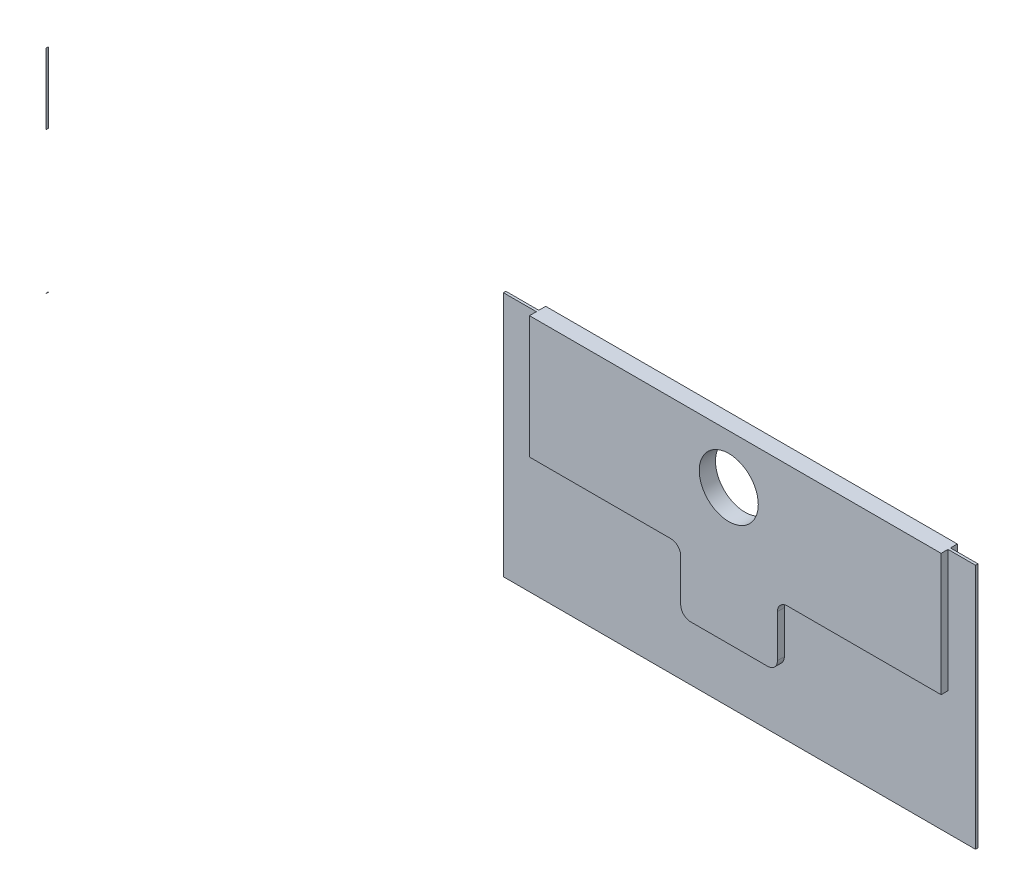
ISO-10303-21;
HEADER;
FILE_DESCRIPTION(('STEP AP214'),'2;1');
FILE_NAME('part.step','',(''),(''),'','','');
FILE_SCHEMA(('AUTOMOTIVE_DESIGN { 1 0 10303 214 1 1 1 1 }'));
ENDSEC;
DATA;
#1=APPLICATION_CONTEXT('core data for automotive mechanical design processes');
#2=APPLICATION_PROTOCOL_DEFINITION('international standard','automotive_design',2000,#1);
#3=PRODUCT_CONTEXT('',#1,'mechanical');
#4=PRODUCT('Part','Part','',(#3));
#5=PRODUCT_RELATED_PRODUCT_CATEGORY('part','',(#4));
#6=PRODUCT_DEFINITION_FORMATION('','',#4);
#7=PRODUCT_DEFINITION_CONTEXT('part definition',#1,'design');
#8=PRODUCT_DEFINITION('design','',#6,#7);
#9=PRODUCT_DEFINITION_SHAPE('','',#8);
#10=(LENGTH_UNIT() NAMED_UNIT(*) SI_UNIT(.MILLI.,.METRE.));
#11=(NAMED_UNIT(*) PLANE_ANGLE_UNIT() SI_UNIT($,.RADIAN.));
#12=(NAMED_UNIT(*) SI_UNIT($,.STERADIAN.) SOLID_ANGLE_UNIT());
#13=UNCERTAINTY_MEASURE_WITH_UNIT(LENGTH_MEASURE(1.E-05),#10,'distance_accuracy_value','');
#14=(GEOMETRIC_REPRESENTATION_CONTEXT(3) GLOBAL_UNCERTAINTY_ASSIGNED_CONTEXT((#13)) GLOBAL_UNIT_ASSIGNED_CONTEXT((#10,
#11,#12)) REPRESENTATION_CONTEXT('',''));
#15=CARTESIAN_POINT('',(0.,0.,0.));
#16=DIRECTION('',(0.,0.,1.));
#17=DIRECTION('',(1.,0.,0.));
#18=AXIS2_PLACEMENT_3D('',#15,#16,#17);
#19=CARTESIAN_POINT('',(271.018000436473,264.185400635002,0.264160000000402));
#20=DIRECTION('',(0.,1.,0.));
#21=DIRECTION('',(-1.,0.,0.));
#22=AXIS2_PLACEMENT_3D('',#19,#20,#21);
#23=PLANE('',#22);
#24=DIRECTION('',(0.,0.,1.));
#25=VECTOR('',#24,1.);
#26=CARTESIAN_POINT('',(203.474275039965,264.185400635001,0.264160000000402));
#27=LINE('',#26,#25);
#28=CARTESIAN_POINT('',(203.474275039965,264.185400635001,0.264160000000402));
#29=VERTEX_POINT('',#28);
#30=CARTESIAN_POINT('',(203.474275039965,264.185400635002,0.391160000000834));
#31=VERTEX_POINT('',#30);
#32=EDGE_CURVE('E113',#29,#31,#27,.T.);
#33=ORIENTED_EDGE('',*,*,#32,.F.);
#34=DIRECTION('',(-1.,0.,0.));
#35=VECTOR('',#34,1.);
#36=CARTESIAN_POINT('',(271.018000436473,264.185400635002,0.264160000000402));
#37=LINE('',#36,#35);
#38=CARTESIAN_POINT('',(202.051875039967,264.185400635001,0.264160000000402));
#39=VERTEX_POINT('',#38);
#40=EDGE_CURVE('E261',#29,#39,#37,.T.);
#41=ORIENTED_EDGE('',*,*,#40,.T.);
#42=DIRECTION('',(0.,0.,1.));
#43=VECTOR('',#42,1.);
#44=CARTESIAN_POINT('',(202.051875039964,264.185400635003,-0.0914399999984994));
#45=LINE('',#44,#43);
#46=CARTESIAN_POINT('',(202.051875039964,264.185400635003,-0.0914399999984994));
#47=VERTEX_POINT('',#46);
#48=EDGE_CURVE('E366',#47,#39,#45,.T.);
#49=ORIENTED_EDGE('',*,*,#48,.F.);
#50=DIRECTION('',(-1.,0.,0.));
#51=VECTOR('',#50,1.);
#52=CARTESIAN_POINT('',(-2.66453525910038E-12,264.185400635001,-0.0914399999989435));
#53=LINE('',#52,#51);
#54=CARTESIAN_POINT('',(180.792075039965,264.185400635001,-0.0914399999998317));
#55=VERTEX_POINT('',#54);
#56=EDGE_CURVE('E263',#47,#55,#53,.T.);
#57=ORIENTED_EDGE('',*,*,#56,.T.);
#58=DIRECTION('',(0.,0.,1.));
#59=VECTOR('',#58,1.);
#60=CARTESIAN_POINT('',(180.792075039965,264.185400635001,-0.0914399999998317));
#61=LINE('',#60,#59);
#62=CARTESIAN_POINT('',(180.792075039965,264.185400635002,0.264160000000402));
#63=VERTEX_POINT('',#62);
#64=EDGE_CURVE('E375',#55,#63,#61,.T.);
#65=ORIENTED_EDGE('',*,*,#64,.T.);
#66=CARTESIAN_POINT('',(179.090275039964,264.185402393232,0.264159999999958));
#67=VERTEX_POINT('',#66);
#68=EDGE_CURVE('E265',#63,#67,#37,.T.);
#69=ORIENTED_EDGE('',*,*,#68,.T.);
#70=DIRECTION('',(0.,0.,-1.));
#71=VECTOR('',#70,1.);
#72=CARTESIAN_POINT('',(179.090275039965,264.185400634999,0.264159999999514));
#73=LINE('',#72,#71);
#74=CARTESIAN_POINT('',(179.090275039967,264.185401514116,0.391159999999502));
#75=VERTEX_POINT('',#74);
#76=EDGE_CURVE('E385',#75,#67,#73,.T.);
#77=ORIENTED_EDGE('',*,*,#76,.F.);
#78=DIRECTION('',(-1.,0.,0.));
#79=VECTOR('',#78,1.);
#80=CARTESIAN_POINT('',(271.018000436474,264.185400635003,0.391159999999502));
#81=LINE('',#80,#79);
#82=CARTESIAN_POINT('',(180.792075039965,264.18540068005,0.39116000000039));
#83=VERTEX_POINT('',#82);
#84=EDGE_CURVE('E255',#83,#75,#81,.T.);
#85=ORIENTED_EDGE('',*,*,#84,.F.);
#86=DIRECTION('',(0.,0.,-1.));
#87=VECTOR('',#86,1.);
#88=CARTESIAN_POINT('',(180.792075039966,264.185400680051,0.74676000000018));
#89=LINE('',#88,#87);
#90=CARTESIAN_POINT('',(180.792075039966,264.185400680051,0.74676000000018));
#91=VERTEX_POINT('',#90);
#92=EDGE_CURVE('E305',#91,#83,#89,.T.);
#93=ORIENTED_EDGE('',*,*,#92,.F.);
#94=DIRECTION('',(1.,5.29618077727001E-08,0.));
#95=VECTOR('',#94,1.);
#96=CARTESIAN_POINT('',(-1.39917371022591E-05,264.185391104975,0.746760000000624));
#97=LINE('',#96,#95);
#98=CARTESIAN_POINT('',(202.051875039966,264.185401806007,0.74676000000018));
#99=VERTEX_POINT('',#98);
#100=EDGE_CURVE('E304',#91,#99,#97,.T.);
#101=ORIENTED_EDGE('',*,*,#100,.T.);
#102=DIRECTION('',(0.,0.,-1.));
#103=VECTOR('',#102,1.);
#104=CARTESIAN_POINT('',(202.051875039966,264.185401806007,0.74676000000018));
#105=LINE('',#104,#103);
#106=CARTESIAN_POINT('',(202.051875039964,264.185400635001,0.391160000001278));
#107=VERTEX_POINT('',#106);
#108=EDGE_CURVE('E264',#99,#107,#105,.T.);
#109=ORIENTED_EDGE('',*,*,#108,.T.);
#110=EDGE_CURVE('E250',#31,#107,#81,.T.);
#111=ORIENTED_EDGE('',*,*,#110,.F.);
#112=EDGE_LOOP('',(#33,#41,#49,#57,#65,#69,#77,#85,#93,#101,#109,#111));
#113=FACE_BOUND('',#112,.T.);
#114=ADVANCED_FACE('F99',(#113),#23,.T.);
#115=CARTESIAN_POINT('',(156.336999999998,251.477947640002,0.264160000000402));
#116=DIRECTION('',(0.,-1.,0.));
#117=DIRECTION('',(0.,0.,-1.));
#118=AXIS2_PLACEMENT_3D('',#115,#116,#117);
#119=PLANE('',#118);
#120=DIRECTION('',(0.,0.,-1.));
#121=VECTOR('',#120,1.);
#122=CARTESIAN_POINT('',(203.474275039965,251.477947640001,0.264160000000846));
#123=LINE('',#122,#121);
#124=CARTESIAN_POINT('',(203.474275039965,251.477947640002,0.391160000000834));
#125=VERTEX_POINT('',#124);
#126=CARTESIAN_POINT('',(203.474275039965,251.477947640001,0.264160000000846));
#127=VERTEX_POINT('',#126);
#128=EDGE_CURVE('E233',#125,#127,#123,.T.);
#129=ORIENTED_EDGE('',*,*,#128,.F.);
#130=DIRECTION('',(1.,0.,0.));
#131=VECTOR('',#130,1.);
#132=CARTESIAN_POINT('',(156.337,251.477947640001,0.391159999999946));
#133=LINE('',#132,#131);
#134=CARTESIAN_POINT('',(179.090275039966,251.477947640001,0.391160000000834));
#135=VERTEX_POINT('',#134);
#136=EDGE_CURVE('E243',#135,#125,#133,.T.);
#137=ORIENTED_EDGE('',*,*,#136,.F.);
#138=DIRECTION('',(0.,0.,1.));
#139=VECTOR('',#138,1.);
#140=CARTESIAN_POINT('',(179.090275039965,251.477947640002,0.264160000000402));
#141=LINE('',#140,#139);
#142=CARTESIAN_POINT('',(179.090275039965,251.477947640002,0.264160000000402));
#143=VERTEX_POINT('',#142);
#144=EDGE_CURVE('E391',#143,#135,#141,.T.);
#145=ORIENTED_EDGE('',*,*,#144,.F.);
#146=DIRECTION('',(1.,0.,0.));
#147=VECTOR('',#146,1.);
#148=CARTESIAN_POINT('',(156.336999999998,251.477947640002,0.264160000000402));
#149=LINE('',#148,#147);
#150=CARTESIAN_POINT('',(180.792075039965,251.477947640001,0.264159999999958));
#151=VERTEX_POINT('',#150);
#152=EDGE_CURVE('E266',#143,#151,#149,.T.);
#153=ORIENTED_EDGE('',*,*,#152,.T.);
#154=DIRECTION('',(0.,0.,1.));
#155=VECTOR('',#154,1.);
#156=CARTESIAN_POINT('',(180.792075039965,251.477947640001,-0.0914399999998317));
#157=LINE('',#156,#155);
#158=CARTESIAN_POINT('',(180.792075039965,251.477947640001,-0.0914399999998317));
#159=VERTEX_POINT('',#158);
#160=EDGE_CURVE('E371',#159,#151,#157,.T.);
#161=ORIENTED_EDGE('',*,*,#160,.F.);
#162=DIRECTION('',(-1.,0.,0.));
#163=VECTOR('',#162,1.);
#164=CARTESIAN_POINT('',(-1.77635683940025E-12,251.477947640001,-0.0914399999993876));
#165=LINE('',#164,#163);
#166=CARTESIAN_POINT('',(202.051875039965,251.477947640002,-0.0914399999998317));
#167=VERTEX_POINT('',#166);
#168=EDGE_CURVE('E383',#167,#159,#165,.T.);
#169=ORIENTED_EDGE('',*,*,#168,.F.);
#170=DIRECTION('',(0.,0.,1.));
#171=VECTOR('',#170,1.);
#172=CARTESIAN_POINT('',(202.051875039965,251.477947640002,-0.0914399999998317));
#173=LINE('',#172,#171);
#174=CARTESIAN_POINT('',(202.051875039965,251.477947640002,0.264160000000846));
#175=VERTEX_POINT('',#174);
#176=EDGE_CURVE('E268',#167,#175,#173,.T.);
#177=ORIENTED_EDGE('',*,*,#176,.T.);
#178=EDGE_CURVE('E246',#175,#127,#149,.T.);
#179=ORIENTED_EDGE('',*,*,#178,.T.);
#180=EDGE_LOOP('',(#129,#137,#145,#153,#161,#169,#177,#179));
#181=FACE_BOUND('',#180,.T.);
#182=ADVANCED_FACE('F241',(#181),#119,.T.);
#183=CARTESIAN_POINT('',(-4.44089209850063E-13,8.88178419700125E-13,0.264159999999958));
#184=DIRECTION('',(0.,0.,1.));
#185=DIRECTION('',(1.,0.,0.));
#186=AXIS2_PLACEMENT_3D('',#183,#184,#185);
#187=PLANE('',#186);
#188=ORIENTED_EDGE('',*,*,#40,.F.);
#189=DIRECTION('',(0.,-1.,0.));
#190=VECTOR('',#189,1.);
#191=CARTESIAN_POINT('',(203.474275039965,8.88178419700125E-13,0.264159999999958));
#192=LINE('',#191,#190);
#193=EDGE_CURVE('E349',#29,#127,#192,.T.);
#194=ORIENTED_EDGE('',*,*,#193,.T.);
#195=ORIENTED_EDGE('',*,*,#178,.F.);
#196=DIRECTION('',(0.,-1.,0.));
#197=VECTOR('',#196,1.);
#198=CARTESIAN_POINT('',(202.051875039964,8.88178419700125E-13,0.264159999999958));
#199=LINE('',#198,#197);
#200=EDGE_CURVE('E343',#39,#175,#199,.T.);
#201=ORIENTED_EDGE('',*,*,#200,.F.);
#202=EDGE_LOOP('',(#188,#194,#195,#201));
#203=FACE_BOUND('',#202,.T.);
#204=ADVANCED_FACE('F101',(#203),#187,.F.);
#205=ORIENTED_EDGE('',*,*,#152,.F.);
#206=DIRECTION('',(0.,1.,0.));
#207=VECTOR('',#206,1.);
#208=CARTESIAN_POINT('',(179.090275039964,2.66453525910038E-12,0.264159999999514));
#209=LINE('',#208,#207);
#210=EDGE_CURVE('E379',#143,#67,#209,.T.);
#211=ORIENTED_EDGE('',*,*,#210,.T.);
#212=ORIENTED_EDGE('',*,*,#68,.F.);
#213=DIRECTION('',(0.,-1.,0.));
#214=VECTOR('',#213,1.);
#215=CARTESIAN_POINT('',(180.792075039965,1.77635683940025E-12,0.264160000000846));
#216=LINE('',#215,#214);
#217=EDGE_CURVE('E340',#63,#151,#216,.T.);
#218=ORIENTED_EDGE('',*,*,#217,.T.);
#219=EDGE_LOOP('',(#205,#211,#212,#218));
#220=FACE_BOUND('',#219,.T.);
#221=ADVANCED_FACE('F397',(#220),#187,.F.);
#222=CARTESIAN_POINT('',(191.084199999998,261.645400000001,0.264160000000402));
#223=DIRECTION('',(0.,0.,1.));
#224=DIRECTION('',(1.,0.,0.));
#225=AXIS2_PLACEMENT_3D('',#222,#223,#224);
#226=CYLINDRICAL_SURFACE('',#225,1.524);
#227=CARTESIAN_POINT('',(191.084199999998,261.645400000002,0.746760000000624));
#228=DIRECTION('',(0.,0.,1.));
#229=DIRECTION('',(1.,0.,0.));
#230=AXIS2_PLACEMENT_3D('',#227,#228,#229);
#231=CIRCLE('',#230,1.524);
#232=CARTESIAN_POINT('',(192.608199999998,261.645400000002,0.746760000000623));
#233=VERTEX_POINT('',#232);
#234=EDGE_CURVE('E257',#233,#233,#231,.T.);
#235=ORIENTED_EDGE('',*,*,#234,.T.);
#236=EDGE_LOOP('',(#235));
#237=FACE_BOUND('',#236,.T.);
#238=CARTESIAN_POINT('',(191.084199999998,261.645400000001,-0.0914399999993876));
#239=DIRECTION('',(0.,0.,-1.));
#240=DIRECTION('',(-1.,0.,0.));
#241=AXIS2_PLACEMENT_3D('',#238,#239,#240);
#242=CIRCLE('',#241,1.524);
#243=CARTESIAN_POINT('',(189.560199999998,261.645400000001,-0.091439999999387));
#244=VERTEX_POINT('',#243);
#245=EDGE_CURVE('E251',#244,#244,#242,.T.);
#246=ORIENTED_EDGE('',*,*,#245,.T.);
#247=EDGE_LOOP('',(#246));
#248=FACE_BOUND('',#247,.T.);
#249=ADVANCED_FACE('F423',(#237,#248),#226,.F.);
#250=CARTESIAN_POINT('',(-8.88178419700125E-13,8.88178419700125E-13,0.391160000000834));
#251=DIRECTION('',(0.,0.,1.));
#252=DIRECTION('',(1.,0.,0.));
#253=AXIS2_PLACEMENT_3D('',#250,#251,#252);
#254=PLANE('',#253);
#255=DIRECTION('',(0.,-1.,0.));
#256=VECTOR('',#255,1.);
#257=CARTESIAN_POINT('',(203.474275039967,0.,0.391159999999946));
#258=LINE('',#257,#256);
#259=EDGE_CURVE('E13',#31,#125,#258,.T.);
#260=ORIENTED_EDGE('',*,*,#259,.F.);
#261=ORIENTED_EDGE('',*,*,#110,.T.);
#262=DIRECTION('',(0.,-1.,0.));
#263=VECTOR('',#262,1.);
#264=CARTESIAN_POINT('',(202.051875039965,8.88178419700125E-13,0.391159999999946));
#265=LINE('',#264,#263);
#266=CARTESIAN_POINT('',(202.051875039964,257.861947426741,0.39116000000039));
#267=VERTEX_POINT('',#266);
#268=EDGE_CURVE('E253',#107,#267,#265,.T.);
#269=ORIENTED_EDGE('',*,*,#268,.T.);
#270=DIRECTION('',(1.,0.,0.));
#271=VECTOR('',#270,1.);
#272=CARTESIAN_POINT('',(-4.44089209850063E-13,257.861947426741,0.391159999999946));
#273=LINE('',#272,#271);
#274=CARTESIAN_POINT('',(194.107504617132,257.861947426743,0.391160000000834));
#275=VERTEX_POINT('',#274);
#276=EDGE_CURVE('E293',#275,#267,#273,.T.);
#277=ORIENTED_EDGE('',*,*,#276,.F.);
#278=CARTESIAN_POINT('',(194.10750461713,257.353947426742,0.391159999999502));
#279=DIRECTION('',(0.,0.,1.));
#280=DIRECTION('',(1.,0.,0.));
#281=AXIS2_PLACEMENT_3D('',#278,#279,#280);
#282=CIRCLE('',#281,0.508000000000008);
#283=CARTESIAN_POINT('',(193.599504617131,257.353947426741,0.39116000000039));
#284=VERTEX_POINT('',#283);
#285=EDGE_CURVE('E322',#275,#284,#282,.T.);
#286=ORIENTED_EDGE('',*,*,#285,.T.);
#287=DIRECTION('',(0.,-1.,0.));
#288=VECTOR('',#287,1.);
#289=CARTESIAN_POINT('',(193.599504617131,0.,0.391159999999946));
#290=LINE('',#289,#288);
#291=CARTESIAN_POINT('',(193.599504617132,255.16094764,0.391159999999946));
#292=VERTEX_POINT('',#291);
#293=EDGE_CURVE('E326',#284,#292,#290,.T.);
#294=ORIENTED_EDGE('',*,*,#293,.T.);
#295=CARTESIAN_POINT('',(193.091504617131,255.160947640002,0.39116000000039));
#296=DIRECTION('',(0.,0.,1.));
#297=DIRECTION('',(1.,0.,0.));
#298=AXIS2_PLACEMENT_3D('',#295,#296,#297);
#299=CIRCLE('',#298,0.508000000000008);
#300=CARTESIAN_POINT('',(193.091504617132,254.652947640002,0.391160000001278));
#301=VERTEX_POINT('',#300);
#302=EDGE_CURVE('E281',#301,#292,#299,.T.);
#303=ORIENTED_EDGE('',*,*,#302,.F.);
#304=DIRECTION('',(1.,0.,0.));
#305=VECTOR('',#304,1.);
#306=CARTESIAN_POINT('',(-4.44089209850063E-13,254.652947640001,0.391159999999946));
#307=LINE('',#306,#305);
#308=CARTESIAN_POINT('',(189.110516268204,254.65294764,0.391159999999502));
#309=VERTEX_POINT('',#308);
#310=EDGE_CURVE('E277',#309,#301,#307,.T.);
#311=ORIENTED_EDGE('',*,*,#310,.F.);
#312=CARTESIAN_POINT('',(189.110516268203,255.160947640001,0.391159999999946));
#313=DIRECTION('',(0.,0.,1.));
#314=DIRECTION('',(1.,0.,0.));
#315=AXIS2_PLACEMENT_3D('',#312,#313,#314);
#316=CIRCLE('',#315,0.508000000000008);
#317=CARTESIAN_POINT('',(188.602516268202,255.160947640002,0.39116000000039));
#318=VERTEX_POINT('',#317);
#319=EDGE_CURVE('E328',#309,#318,#316,.F.);
#320=ORIENTED_EDGE('',*,*,#319,.T.);
#321=DIRECTION('',(0.,-1.,0.));
#322=VECTOR('',#321,1.);
#323=CARTESIAN_POINT('',(188.602516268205,8.88178419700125E-13,0.39116000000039));
#324=LINE('',#323,#322);
#325=CARTESIAN_POINT('',(188.602516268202,257.353947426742,0.391159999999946));
#326=VERTEX_POINT('',#325);
#327=EDGE_CURVE('E273',#326,#318,#324,.T.);
#328=ORIENTED_EDGE('',*,*,#327,.F.);
#329=CARTESIAN_POINT('',(188.094516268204,257.353947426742,0.39116000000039));
#330=DIRECTION('',(0.,0.,1.));
#331=DIRECTION('',(1.,0.,0.));
#332=AXIS2_PLACEMENT_3D('',#329,#330,#331);
#333=CIRCLE('',#332,0.508000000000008);
#334=CARTESIAN_POINT('',(188.094516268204,257.861947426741,0.39116000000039));
#335=VERTEX_POINT('',#334);
#336=EDGE_CURVE('E334',#326,#335,#333,.T.);
#337=ORIENTED_EDGE('',*,*,#336,.T.);
#338=DIRECTION('',(1.,0.,0.));
#339=VECTOR('',#338,1.);
#340=CARTESIAN_POINT('',(-4.44089209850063E-13,257.861947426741,0.391159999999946));
#341=LINE('',#340,#339);
#342=CARTESIAN_POINT('',(180.792075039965,257.86194742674,0.39116000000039));
#343=VERTEX_POINT('',#342);
#344=EDGE_CURVE('E308',#343,#335,#341,.T.);
#345=ORIENTED_EDGE('',*,*,#344,.F.);
#346=DIRECTION('',(0.,-1.,0.));
#347=VECTOR('',#346,1.);
#348=CARTESIAN_POINT('',(180.792075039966,1.77635683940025E-12,0.391159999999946));
#349=LINE('',#348,#347);
#350=EDGE_CURVE('E301',#83,#343,#349,.T.);
#351=ORIENTED_EDGE('',*,*,#350,.F.);
#352=ORIENTED_EDGE('',*,*,#84,.T.);
#353=DIRECTION('',(0.,1.,0.));
#354=VECTOR('',#353,1.);
#355=CARTESIAN_POINT('',(179.090275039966,1.77635683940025E-12,0.39116000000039));
#356=LINE('',#355,#354);
#357=EDGE_CURVE('E107',#135,#75,#356,.T.);
#358=ORIENTED_EDGE('',*,*,#357,.F.);
#359=ORIENTED_EDGE('',*,*,#136,.T.);
#360=EDGE_LOOP('',(#260,#261,#269,#277,#286,#294,#303,#311,#320,#328,#337,#345,#351,#352,#358,#359));
#361=FACE_BOUND('',#360,.T.);
#362=ADVANCED_FACE('F248',(#361),#254,.T.);
#363=CARTESIAN_POINT('',(188.094516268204,257.353947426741,0.74676000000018));
#364=DIRECTION('',(0.,0.,-1.));
#365=DIRECTION('',(-1.,0.,0.));
#366=AXIS2_PLACEMENT_3D('',#363,#364,#365);
#367=CYLINDRICAL_SURFACE('',#366,0.508000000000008);
#368=ORIENTED_EDGE('',*,*,#336,.F.);
#369=DIRECTION('',(0.,0.,-1.));
#370=VECTOR('',#369,1.);
#371=CARTESIAN_POINT('',(188.602516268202,257.353947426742,0.74676000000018));
#372=LINE('',#371,#370);
#373=CARTESIAN_POINT('',(188.602516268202,257.353947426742,0.74676000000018));
#374=VERTEX_POINT('',#373);
#375=EDGE_CURVE('E269',#374,#326,#372,.T.);
#376=ORIENTED_EDGE('',*,*,#375,.F.);
#377=CARTESIAN_POINT('',(188.094516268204,257.353947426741,0.74676000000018));
#378=DIRECTION('',(0.,0.,1.));
#379=DIRECTION('',(1.,0.,0.));
#380=AXIS2_PLACEMENT_3D('',#377,#378,#379);
#381=CIRCLE('',#380,0.508000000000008);
#382=CARTESIAN_POINT('',(188.094516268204,257.861947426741,0.746760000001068));
#383=VERTEX_POINT('',#382);
#384=EDGE_CURVE('E316',#374,#383,#381,.T.);
#385=ORIENTED_EDGE('',*,*,#384,.T.);
#386=DIRECTION('',(0.,0.,-1.));
#387=VECTOR('',#386,1.);
#388=CARTESIAN_POINT('',(188.094516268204,257.861947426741,0.746760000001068));
#389=LINE('',#388,#387);
#390=EDGE_CURVE('E313',#383,#335,#389,.T.);
#391=ORIENTED_EDGE('',*,*,#390,.T.);
#392=EDGE_LOOP('',(#368,#376,#385,#391));
#393=FACE_BOUND('',#392,.T.);
#394=ADVANCED_FACE('F427',(#393),#367,.F.);
#395=CARTESIAN_POINT('',(188.602516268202,8.88178419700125E-13,0.746760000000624));
#396=DIRECTION('',(1.,0.,0.));
#397=DIRECTION('',(0.,0.,-1.));
#398=AXIS2_PLACEMENT_3D('',#395,#396,#397);
#399=PLANE('',#398);
#400=ORIENTED_EDGE('',*,*,#327,.T.);
#401=DIRECTION('',(0.,0.,-1.));
#402=VECTOR('',#401,1.);
#403=CARTESIAN_POINT('',(188.602516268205,255.16094764,0.746759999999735));
#404=LINE('',#403,#402);
#405=CARTESIAN_POINT('',(188.602516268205,255.16094764,0.746759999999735));
#406=VERTEX_POINT('',#405);
#407=EDGE_CURVE('E274',#406,#318,#404,.T.);
#408=ORIENTED_EDGE('',*,*,#407,.F.);
#409=DIRECTION('',(0.,-1.,0.));
#410=VECTOR('',#409,1.);
#411=CARTESIAN_POINT('',(188.602516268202,8.88178419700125E-13,0.746760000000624));
#412=LINE('',#411,#410);
#413=EDGE_CURVE('E312',#374,#406,#412,.T.);
#414=ORIENTED_EDGE('',*,*,#413,.F.);
#415=ORIENTED_EDGE('',*,*,#375,.T.);
#416=EDGE_LOOP('',(#400,#408,#414,#415));
#417=FACE_BOUND('',#416,.T.);
#418=ADVANCED_FACE('F430',(#417),#399,.F.);
#419=CARTESIAN_POINT('',(189.110516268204,255.160947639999,0.746759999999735));
#420=DIRECTION('',(0.,0.,-1.));
#421=DIRECTION('',(-1.,0.,0.));
#422=AXIS2_PLACEMENT_3D('',#419,#420,#421);
#423=CYLINDRICAL_SURFACE('',#422,0.508000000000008);
#424=ORIENTED_EDGE('',*,*,#319,.F.);
#425=DIRECTION('',(0.,0.,-1.));
#426=VECTOR('',#425,1.);
#427=CARTESIAN_POINT('',(189.110516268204,254.65294764,0.746759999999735));
#428=LINE('',#427,#426);
#429=CARTESIAN_POINT('',(189.110516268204,254.65294764,0.746759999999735));
#430=VERTEX_POINT('',#429);
#431=EDGE_CURVE('E278',#430,#309,#428,.T.);
#432=ORIENTED_EDGE('',*,*,#431,.F.);
#433=CARTESIAN_POINT('',(189.110516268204,255.160947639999,0.746759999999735));
#434=DIRECTION('',(0.,0.,1.));
#435=DIRECTION('',(1.,0.,0.));
#436=AXIS2_PLACEMENT_3D('',#433,#434,#435);
#437=CIRCLE('',#436,0.508000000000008);
#438=EDGE_CURVE('E272',#430,#406,#437,.F.);
#439=ORIENTED_EDGE('',*,*,#438,.T.);
#440=ORIENTED_EDGE('',*,*,#407,.T.);
#441=EDGE_LOOP('',(#424,#432,#439,#440));
#442=FACE_BOUND('',#441,.T.);
#443=ADVANCED_FACE('F434',(#442),#423,.T.);
#444=CARTESIAN_POINT('',(-1.33226762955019E-12,254.65294764,0.74676000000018));
#445=DIRECTION('',(0.,1.,0.));
#446=DIRECTION('',(0.,0.,1.));
#447=AXIS2_PLACEMENT_3D('',#444,#445,#446);
#448=PLANE('',#447);
#449=ORIENTED_EDGE('',*,*,#310,.T.);
#450=DIRECTION('',(0.,0.,-1.));
#451=VECTOR('',#450,1.);
#452=CARTESIAN_POINT('',(193.091504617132,254.652947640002,0.746760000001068));
#453=LINE('',#452,#451);
#454=CARTESIAN_POINT('',(193.091504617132,254.652947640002,0.746760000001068));
#455=VERTEX_POINT('',#454);
#456=EDGE_CURVE('E282',#455,#301,#453,.T.);
#457=ORIENTED_EDGE('',*,*,#456,.F.);
#458=DIRECTION('',(1.,0.,0.));
#459=VECTOR('',#458,1.);
#460=CARTESIAN_POINT('',(-1.33226762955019E-12,254.65294764,0.74676000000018));
#461=LINE('',#460,#459);
#462=EDGE_CURVE('E359',#430,#455,#461,.T.);
#463=ORIENTED_EDGE('',*,*,#462,.F.);
#464=ORIENTED_EDGE('',*,*,#431,.T.);
#465=EDGE_LOOP('',(#449,#457,#463,#464));
#466=FACE_BOUND('',#465,.T.);
#467=ADVANCED_FACE('F438',(#466),#448,.F.);
#468=CARTESIAN_POINT('',(193.091504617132,255.160947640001,0.746760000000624));
#469=DIRECTION('',(0.,0.,-1.));
#470=DIRECTION('',(-1.,0.,0.));
#471=AXIS2_PLACEMENT_3D('',#468,#469,#470);
#472=CYLINDRICAL_SURFACE('',#471,0.508000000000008);
#473=ORIENTED_EDGE('',*,*,#302,.T.);
#474=DIRECTION('',(0.,0.,-1.));
#475=VECTOR('',#474,1.);
#476=CARTESIAN_POINT('',(193.599504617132,255.160947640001,0.74676000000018));
#477=LINE('',#476,#475);
#478=CARTESIAN_POINT('',(193.599504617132,255.160947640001,0.74676000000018));
#479=VERTEX_POINT('',#478);
#480=EDGE_CURVE('E286',#479,#292,#477,.T.);
#481=ORIENTED_EDGE('',*,*,#480,.F.);
#482=CARTESIAN_POINT('',(193.091504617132,255.160947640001,0.746760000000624));
#483=DIRECTION('',(0.,0.,1.));
#484=DIRECTION('',(1.,0.,0.));
#485=AXIS2_PLACEMENT_3D('',#482,#483,#484);
#486=CIRCLE('',#485,0.508000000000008);
#487=EDGE_CURVE('E353',#455,#479,#486,.T.);
#488=ORIENTED_EDGE('',*,*,#487,.F.);
#489=ORIENTED_EDGE('',*,*,#456,.T.);
#490=EDGE_LOOP('',(#473,#481,#488,#489));
#491=FACE_BOUND('',#490,.T.);
#492=ADVANCED_FACE('F442',(#491),#472,.T.);
#493=CARTESIAN_POINT('',(193.599504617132,8.88178419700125E-13,0.746760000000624));
#494=DIRECTION('',(1.,0.,0.));
#495=DIRECTION('',(0.,0.,-1.));
#496=AXIS2_PLACEMENT_3D('',#493,#494,#495);
#497=PLANE('',#496);
#498=ORIENTED_EDGE('',*,*,#293,.F.);
#499=DIRECTION('',(0.,0.,-1.));
#500=VECTOR('',#499,1.);
#501=CARTESIAN_POINT('',(193.599504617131,257.35394742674,0.746760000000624));
#502=LINE('',#501,#500);
#503=CARTESIAN_POINT('',(193.599504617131,257.35394742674,0.746760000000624));
#504=VERTEX_POINT('',#503);
#505=EDGE_CURVE('E290',#504,#284,#502,.T.);
#506=ORIENTED_EDGE('',*,*,#505,.F.);
#507=DIRECTION('',(0.,-1.,0.));
#508=VECTOR('',#507,1.);
#509=CARTESIAN_POINT('',(193.599504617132,8.88178419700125E-13,0.746760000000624));
#510=LINE('',#509,#508);
#511=EDGE_CURVE('E285',#504,#479,#510,.T.);
#512=ORIENTED_EDGE('',*,*,#511,.T.);
#513=ORIENTED_EDGE('',*,*,#480,.T.);
#514=EDGE_LOOP('',(#498,#506,#512,#513));
#515=FACE_BOUND('',#514,.T.);
#516=ADVANCED_FACE('F446',(#515),#497,.T.);
#517=CARTESIAN_POINT('',(194.107504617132,257.353947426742,0.746760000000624));
#518=DIRECTION('',(0.,0.,-1.));
#519=DIRECTION('',(-1.,0.,0.));
#520=AXIS2_PLACEMENT_3D('',#517,#518,#519);
#521=CYLINDRICAL_SURFACE('',#520,0.508000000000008);
#522=ORIENTED_EDGE('',*,*,#285,.F.);
#523=DIRECTION('',(0.,0.,-1.));
#524=VECTOR('',#523,1.);
#525=CARTESIAN_POINT('',(194.107504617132,257.861947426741,0.746760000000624));
#526=LINE('',#525,#524);
#527=CARTESIAN_POINT('',(194.107504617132,257.861947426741,0.746760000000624));
#528=VERTEX_POINT('',#527);
#529=EDGE_CURVE('E294',#528,#275,#526,.T.);
#530=ORIENTED_EDGE('',*,*,#529,.F.);
#531=CARTESIAN_POINT('',(194.107504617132,257.353947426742,0.746760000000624));
#532=DIRECTION('',(0.,0.,1.));
#533=DIRECTION('',(1.,0.,0.));
#534=AXIS2_PLACEMENT_3D('',#531,#532,#533);
#535=CIRCLE('',#534,0.508000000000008);
#536=EDGE_CURVE('E289',#528,#504,#535,.T.);
#537=ORIENTED_EDGE('',*,*,#536,.T.);
#538=ORIENTED_EDGE('',*,*,#505,.T.);
#539=EDGE_LOOP('',(#522,#530,#537,#538));
#540=FACE_BOUND('',#539,.T.);
#541=ADVANCED_FACE('F450',(#540),#521,.F.);
#542=CARTESIAN_POINT('',(-8.88178419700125E-13,257.861947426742,0.74676000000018));
#543=DIRECTION('',(0.,1.,0.));
#544=DIRECTION('',(0.,0.,1.));
#545=AXIS2_PLACEMENT_3D('',#542,#543,#544);
#546=PLANE('',#545);
#547=ORIENTED_EDGE('',*,*,#276,.T.);
#548=DIRECTION('',(0.,0.,-1.));
#549=VECTOR('',#548,1.);
#550=CARTESIAN_POINT('',(202.051875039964,257.861947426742,0.74676000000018));
#551=LINE('',#550,#549);
#552=CARTESIAN_POINT('',(202.051875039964,257.861947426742,0.74676000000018));
#553=VERTEX_POINT('',#552);
#554=EDGE_CURVE('E298',#553,#267,#551,.T.);
#555=ORIENTED_EDGE('',*,*,#554,.F.);
#556=DIRECTION('',(1.,0.,0.));
#557=VECTOR('',#556,1.);
#558=CARTESIAN_POINT('',(-8.88178419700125E-13,257.861947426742,0.74676000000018));
#559=LINE('',#558,#557);
#560=EDGE_CURVE('E346',#528,#553,#559,.T.);
#561=ORIENTED_EDGE('',*,*,#560,.F.);
#562=ORIENTED_EDGE('',*,*,#529,.T.);
#563=EDGE_LOOP('',(#547,#555,#561,#562));
#564=FACE_BOUND('',#563,.T.);
#565=ADVANCED_FACE('F454',(#564),#546,.F.);
#566=CARTESIAN_POINT('',(202.051875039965,0.,0.74676000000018));
#567=DIRECTION('',(1.,0.,0.));
#568=DIRECTION('',(0.,0.,-1.));
#569=AXIS2_PLACEMENT_3D('',#566,#567,#568);
#570=PLANE('',#569);
#571=ORIENTED_EDGE('',*,*,#268,.F.);
#572=ORIENTED_EDGE('',*,*,#108,.F.);
#573=DIRECTION('',(0.,-1.,0.));
#574=VECTOR('',#573,1.);
#575=CARTESIAN_POINT('',(202.051875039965,0.,0.74676000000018));
#576=LINE('',#575,#574);
#577=EDGE_CURVE('E297',#99,#553,#576,.T.);
#578=ORIENTED_EDGE('',*,*,#577,.T.);
#579=ORIENTED_EDGE('',*,*,#554,.T.);
#580=EDGE_LOOP('',(#571,#572,#578,#579));
#581=FACE_BOUND('',#580,.T.);
#582=ADVANCED_FACE('F458',(#581),#570,.T.);
#583=CARTESIAN_POINT('',(180.792075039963,8.88178419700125E-13,0.746759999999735));
#584=DIRECTION('',(1.,0.,0.));
#585=DIRECTION('',(0.,0.,-1.));
#586=AXIS2_PLACEMENT_3D('',#583,#584,#585);
#587=PLANE('',#586);
#588=ORIENTED_EDGE('',*,*,#350,.T.);
#589=DIRECTION('',(0.,0.,-1.));
#590=VECTOR('',#589,1.);
#591=CARTESIAN_POINT('',(180.792075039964,257.861947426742,0.746760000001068));
#592=LINE('',#591,#590);
#593=CARTESIAN_POINT('',(180.792075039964,257.861947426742,0.746760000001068));
#594=VERTEX_POINT('',#593);
#595=EDGE_CURVE('E309',#594,#343,#592,.T.);
#596=ORIENTED_EDGE('',*,*,#595,.F.);
#597=DIRECTION('',(0.,-1.,0.));
#598=VECTOR('',#597,1.);
#599=CARTESIAN_POINT('',(180.792075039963,8.88178419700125E-13,0.746759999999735));
#600=LINE('',#599,#598);
#601=EDGE_CURVE('E344',#91,#594,#600,.T.);
#602=ORIENTED_EDGE('',*,*,#601,.F.);
#603=ORIENTED_EDGE('',*,*,#92,.T.);
#604=EDGE_LOOP('',(#588,#596,#602,#603));
#605=FACE_BOUND('',#604,.T.);
#606=ADVANCED_FACE('F462',(#605),#587,.F.);
#607=CARTESIAN_POINT('',(-8.88178419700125E-13,257.861947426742,0.74676000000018));
#608=DIRECTION('',(0.,1.,0.));
#609=DIRECTION('',(0.,0.,1.));
#610=AXIS2_PLACEMENT_3D('',#607,#608,#609);
#611=PLANE('',#610);
#612=ORIENTED_EDGE('',*,*,#344,.T.);
#613=ORIENTED_EDGE('',*,*,#390,.F.);
#614=DIRECTION('',(1.,0.,0.));
#615=VECTOR('',#614,1.);
#616=CARTESIAN_POINT('',(-8.88178419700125E-13,257.861947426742,0.74676000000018));
#617=LINE('',#616,#615);
#618=EDGE_CURVE('E341',#594,#383,#617,.T.);
#619=ORIENTED_EDGE('',*,*,#618,.F.);
#620=ORIENTED_EDGE('',*,*,#595,.T.);
#621=EDGE_LOOP('',(#612,#613,#619,#620));
#622=FACE_BOUND('',#621,.T.);
#623=ADVANCED_FACE('F466',(#622),#611,.F.);
#624=CARTESIAN_POINT('',(-8.88178419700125E-13,8.88178419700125E-13,0.74676000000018));
#625=DIRECTION('',(0.,0.,1.));
#626=DIRECTION('',(1.,0.,0.));
#627=AXIS2_PLACEMENT_3D('',#624,#625,#626);
#628=PLANE('',#627);
#629=ORIENTED_EDGE('',*,*,#384,.F.);
#630=ORIENTED_EDGE('',*,*,#413,.T.);
#631=ORIENTED_EDGE('',*,*,#438,.F.);
#632=ORIENTED_EDGE('',*,*,#462,.T.);
#633=ORIENTED_EDGE('',*,*,#487,.T.);
#634=ORIENTED_EDGE('',*,*,#511,.F.);
#635=ORIENTED_EDGE('',*,*,#536,.F.);
#636=ORIENTED_EDGE('',*,*,#560,.T.);
#637=ORIENTED_EDGE('',*,*,#577,.F.);
#638=ORIENTED_EDGE('',*,*,#100,.F.);
#639=ORIENTED_EDGE('',*,*,#601,.T.);
#640=ORIENTED_EDGE('',*,*,#618,.T.);
#641=EDGE_LOOP('',(#629,#630,#631,#632,#633,#634,#635,#636,#637,#638,#639,#640));
#642=FACE_BOUND('',#641,.T.);
#643=ORIENTED_EDGE('',*,*,#234,.F.);
#644=EDGE_LOOP('',(#643));
#645=FACE_BOUND('',#644,.T.);
#646=ADVANCED_FACE('F470',(#642,#645),#628,.T.);
#647=CARTESIAN_POINT('',(202.051875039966,2.66453525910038E-12,-0.0914399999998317));
#648=DIRECTION('',(-1.,0.,0.));
#649=DIRECTION('',(0.,0.,1.));
#650=AXIS2_PLACEMENT_3D('',#647,#648,#649);
#651=PLANE('',#650);
#652=ORIENTED_EDGE('',*,*,#200,.T.);
#653=ORIENTED_EDGE('',*,*,#176,.F.);
#654=DIRECTION('',(0.,-1.,0.));
#655=VECTOR('',#654,1.);
#656=CARTESIAN_POINT('',(202.051875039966,2.66453525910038E-12,-0.0914399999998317));
#657=LINE('',#656,#655);
#658=EDGE_CURVE('E374',#47,#167,#657,.T.);
#659=ORIENTED_EDGE('',*,*,#658,.F.);
#660=ORIENTED_EDGE('',*,*,#48,.T.);
#661=EDGE_LOOP('',(#652,#653,#659,#660));
#662=FACE_BOUND('',#661,.T.);
#663=ADVANCED_FACE('F474',(#662),#651,.F.);
#664=CARTESIAN_POINT('',(180.792075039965,0.,-0.0914400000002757));
#665=DIRECTION('',(-1.,0.,0.));
#666=DIRECTION('',(0.,0.,1.));
#667=AXIS2_PLACEMENT_3D('',#664,#665,#666);
#668=PLANE('',#667);
#669=ORIENTED_EDGE('',*,*,#217,.F.);
#670=ORIENTED_EDGE('',*,*,#64,.F.);
#671=DIRECTION('',(0.,-1.,0.));
#672=VECTOR('',#671,1.);
#673=CARTESIAN_POINT('',(180.792075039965,0.,-0.0914400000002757));
#674=LINE('',#673,#672);
#675=EDGE_CURVE('E369',#55,#159,#674,.T.);
#676=ORIENTED_EDGE('',*,*,#675,.T.);
#677=ORIENTED_EDGE('',*,*,#160,.T.);
#678=EDGE_LOOP('',(#669,#670,#676,#677));
#679=FACE_BOUND('',#678,.T.);
#680=ADVANCED_FACE('F403',(#679),#668,.T.);
#681=CARTESIAN_POINT('',(-1.33226762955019E-12,1.77635683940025E-12,-0.0914399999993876));
#682=DIRECTION('',(0.,0.,-1.));
#683=DIRECTION('',(-1.,0.,0.));
#684=AXIS2_PLACEMENT_3D('',#681,#682,#683);
#685=PLANE('',#684);
#686=ORIENTED_EDGE('',*,*,#245,.F.);
#687=EDGE_LOOP('',(#686));
#688=FACE_BOUND('',#687,.T.);
#689=ORIENTED_EDGE('',*,*,#56,.F.);
#690=ORIENTED_EDGE('',*,*,#658,.T.);
#691=ORIENTED_EDGE('',*,*,#168,.T.);
#692=ORIENTED_EDGE('',*,*,#675,.F.);
#693=EDGE_LOOP('',(#689,#690,#691,#692));
#694=FACE_BOUND('',#693,.T.);
#695=ADVANCED_FACE('F407',(#688,#694),#685,.T.);
#696=CARTESIAN_POINT('',(179.090275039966,267.569102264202,-2.14884000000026));
#697=DIRECTION('',(1.,0.,0.));
#698=DIRECTION('',(0.,0.,-1.));
#699=AXIS2_PLACEMENT_3D('',#696,#697,#698);
#700=PLANE('',#699);
#701=ORIENTED_EDGE('',*,*,#76,.T.);
#702=ORIENTED_EDGE('',*,*,#210,.F.);
#703=ORIENTED_EDGE('',*,*,#144,.T.);
#704=ORIENTED_EDGE('',*,*,#357,.T.);
#705=EDGE_LOOP('',(#701,#702,#703,#704));
#706=FACE_BOUND('',#705,.T.);
#707=ADVANCED_FACE('F405',(#706),#700,.F.);
#708=CARTESIAN_POINT('',(203.474275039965,267.424929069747,-1.79323999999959));
#709=DIRECTION('',(-1.,0.,0.));
#710=DIRECTION('',(0.,0.,1.));
#711=AXIS2_PLACEMENT_3D('',#708,#709,#710);
#712=PLANE('',#711);
#713=ORIENTED_EDGE('',*,*,#32,.T.);
#714=ORIENTED_EDGE('',*,*,#259,.T.);
#715=ORIENTED_EDGE('',*,*,#128,.T.);
#716=ORIENTED_EDGE('',*,*,#193,.F.);
#717=EDGE_LOOP('',(#713,#714,#715,#716));
#718=FACE_BOUND('',#717,.T.);
#719=ADVANCED_FACE('F232',(#718),#712,.F.);
#720=CLOSED_SHELL('',(#114,#182,#204,#221,#249,#362,#394,#418,#443,#467,#492,#516,#541,#565,
#582,#606,#623,#646,#663,#680,#695,#707,#719));
#721=MANIFOLD_SOLID_BREP('B2',#720);
#722=CARTESIAN_POINT('',(-8.88178419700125E-13,8.88178419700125E-13,0.391160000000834));
#723=DIRECTION('',(0.,0.,1.));
#724=DIRECTION('',(1.,0.,0.));
#725=AXIS2_PLACEMENT_3D('',#722,#723,#724);
#726=PLANE('',#725);
#727=DIRECTION('',(0.,-1.,0.));
#728=VECTOR('',#727,1.);
#729=CARTESIAN_POINT('',(155.468275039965,8.88178419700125E-13,0.39116000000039));
#730=LINE('',#729,#728);
#731=CARTESIAN_POINT('',(155.468275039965,252.349000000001,0.391159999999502));
#732=VERTEX_POINT('',#731);
#733=CARTESIAN_POINT('',(155.468275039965,252.331321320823,0.39116000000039));
#734=VERTEX_POINT('',#733);
#735=EDGE_CURVE('E710',#732,#734,#730,.T.);
#736=ORIENTED_EDGE('',*,*,#735,.F.);
#737=DIRECTION('',(-1.,0.,0.));
#738=VECTOR('',#737,1.);
#739=CARTESIAN_POINT('',(155.4734,252.349000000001,0.391159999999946));
#740=LINE('',#739,#738);
#741=CARTESIAN_POINT('',(155.46594764,252.349000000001,0.39116000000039));
#742=VERTEX_POINT('',#741);
#743=EDGE_CURVE('E731',#732,#742,#740,.T.);
#744=ORIENTED_EDGE('',*,*,#743,.T.);
#745=DIRECTION('',(0.130523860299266,-0.991445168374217,0.));
#746=VECTOR('',#745,1.);
#747=CARTESIAN_POINT('',(155.46594764,252.349000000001,0.39116000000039));
#748=LINE('',#747,#746);
#749=EDGE_CURVE('E734',#742,#734,#748,.T.);
#750=ORIENTED_EDGE('',*,*,#749,.T.);
#751=EDGE_LOOP('',(#736,#744,#750));
#752=FACE_BOUND('',#751,.T.);
#753=ADVANCED_FACE('F700',(#752),#726,.T.);
#754=CARTESIAN_POINT('',(155.465947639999,252.349000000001,0.264159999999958));
#755=DIRECTION('',(-0.991445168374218,-0.130523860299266,0.));
#756=DIRECTION('',(0.130523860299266,-0.991445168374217,0.));
#757=AXIS2_PLACEMENT_3D('',#754,#755,#756);
#758=PLANE('',#757);
#759=DIRECTION('',(0.,0.,-1.));
#760=VECTOR('',#759,1.);
#761=CARTESIAN_POINT('',(155.468275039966,252.331321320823,0.264159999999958));
#762=LINE('',#761,#760);
#763=CARTESIAN_POINT('',(155.468275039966,252.331321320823,0.264159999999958));
#764=VERTEX_POINT('',#763);
#765=EDGE_CURVE('E97',#734,#764,#762,.T.);
#766=ORIENTED_EDGE('',*,*,#765,.F.);
#767=ORIENTED_EDGE('',*,*,#749,.F.);
#768=DIRECTION('',(0.,0.,1.));
#769=VECTOR('',#768,1.);
#770=CARTESIAN_POINT('',(155.465947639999,252.349000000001,0.264159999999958));
#771=LINE('',#770,#769);
#772=CARTESIAN_POINT('',(155.465947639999,252.349000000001,0.264159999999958));
#773=VERTEX_POINT('',#772);
#774=EDGE_CURVE('E739',#773,#742,#771,.T.);
#775=ORIENTED_EDGE('',*,*,#774,.F.);
#776=DIRECTION('',(0.130523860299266,-0.991445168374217,0.));
#777=VECTOR('',#776,1.);
#778=CARTESIAN_POINT('',(155.465947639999,252.349000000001,0.264159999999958));
#779=LINE('',#778,#777);
#780=EDGE_CURVE('E749',#773,#764,#779,.T.);
#781=ORIENTED_EDGE('',*,*,#780,.T.);
#782=EDGE_LOOP('',(#766,#767,#775,#781));
#783=FACE_BOUND('',#782,.T.);
#784=ADVANCED_FACE('F748',(#783),#758,.T.);
#785=CARTESIAN_POINT('',(155.4734,252.349000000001,0.264160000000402));
#786=DIRECTION('',(0.,1.,0.));
#787=DIRECTION('',(0.,0.,1.));
#788=AXIS2_PLACEMENT_3D('',#785,#786,#787);
#789=PLANE('',#788);
#790=DIRECTION('',(0.,0.,1.));
#791=VECTOR('',#790,1.);
#792=CARTESIAN_POINT('',(155.468275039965,252.349000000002,0.264160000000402));
#793=LINE('',#792,#791);
#794=CARTESIAN_POINT('',(155.468275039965,252.349000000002,0.264160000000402));
#795=VERTEX_POINT('',#794);
#796=EDGE_CURVE('E754',#795,#732,#793,.T.);
#797=ORIENTED_EDGE('',*,*,#796,.F.);
#798=DIRECTION('',(-1.,0.,0.));
#799=VECTOR('',#798,1.);
#800=CARTESIAN_POINT('',(155.4734,252.349000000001,0.264160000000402));
#801=LINE('',#800,#799);
#802=EDGE_CURVE('E742',#795,#773,#801,.T.);
#803=ORIENTED_EDGE('',*,*,#802,.T.);
#804=ORIENTED_EDGE('',*,*,#774,.T.);
#805=ORIENTED_EDGE('',*,*,#743,.F.);
#806=EDGE_LOOP('',(#797,#803,#804,#805));
#807=FACE_BOUND('',#806,.T.);
#808=ADVANCED_FACE('F740',(#807),#789,.T.);
#809=CARTESIAN_POINT('',(-8.88178419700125E-13,8.88178419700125E-13,0.264160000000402));
#810=DIRECTION('',(0.,0.,1.));
#811=DIRECTION('',(1.,0.,0.));
#812=AXIS2_PLACEMENT_3D('',#809,#810,#811);
#813=PLANE('',#812);
#814=ORIENTED_EDGE('',*,*,#802,.F.);
#815=DIRECTION('',(0.,-1.,0.));
#816=VECTOR('',#815,1.);
#817=CARTESIAN_POINT('',(155.468275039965,1.77635683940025E-12,0.264159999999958));
#818=LINE('',#817,#816);
#819=EDGE_CURVE('E704',#795,#764,#818,.T.);
#820=ORIENTED_EDGE('',*,*,#819,.T.);
#821=ORIENTED_EDGE('',*,*,#780,.F.);
#822=EDGE_LOOP('',(#814,#820,#821));
#823=FACE_BOUND('',#822,.T.);
#824=ADVANCED_FACE('F702',(#823),#813,.F.);
#825=CARTESIAN_POINT('',(155.468275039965,267.569102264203,-2.14883999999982));
#826=DIRECTION('',(-1.,0.,0.));
#827=DIRECTION('',(0.,0.,1.));
#828=AXIS2_PLACEMENT_3D('',#825,#826,#827);
#829=PLANE('',#828);
#830=ORIENTED_EDGE('',*,*,#796,.T.);
#831=ORIENTED_EDGE('',*,*,#735,.T.);
#832=ORIENTED_EDGE('',*,*,#765,.T.);
#833=ORIENTED_EDGE('',*,*,#819,.F.);
#834=EDGE_LOOP('',(#830,#831,#832,#833));
#835=FACE_BOUND('',#834,.T.);
#836=ADVANCED_FACE('F755',(#835),#829,.F.);
#837=CLOSED_SHELL('',(#753,#784,#808,#824,#836));
#838=MANIFOLD_SOLID_BREP('B7',#837);
#839=CARTESIAN_POINT('',(0.,0.,0.39116));
#840=DIRECTION('',(0.,0.,1.));
#841=DIRECTION('',(1.,0.,0.));
#842=AXIS2_PLACEMENT_3D('',#839,#840,#841);
#843=PLANE('',#842);
#844=DIRECTION('',(0.,-1.,0.));
#845=VECTOR('',#844,1.);
#846=CARTESIAN_POINT('',(155.468275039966,0.,0.39116));
#847=LINE('',#846,#845);
#848=CARTESIAN_POINT('',(155.468275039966,263.31573925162,0.39116));
#849=VERTEX_POINT('',#848);
#850=CARTESIAN_POINT('',(155.468275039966,259.663099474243,0.39116));
#851=VERTEX_POINT('',#850);
#852=EDGE_CURVE('E698',#849,#851,#847,.T.);
#853=ORIENTED_EDGE('',*,*,#852,.F.);
#854=DIRECTION('',(-0.130527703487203,-0.991444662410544,0.));
#855=VECTOR('',#854,1.);
#856=CARTESIAN_POINT('',(155.49628286,263.52847726,0.39116));
#857=LINE('',#856,#855);
#858=CARTESIAN_POINT('',(155.465729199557,263.296401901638,0.39116));
#859=VERTEX_POINT('',#858);
#860=EDGE_CURVE('E846',#849,#859,#857,.T.);
#861=ORIENTED_EDGE('',*,*,#860,.T.);
#862=DIRECTION('',(0.000700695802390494,-0.999999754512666,0.));
#863=VECTOR('',#862,1.);
#864=CARTESIAN_POINT('',(155.465729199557,263.296401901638,0.39116));
#865=LINE('',#864,#863);
#866=EDGE_CURVE('E843',#859,#851,#865,.T.);
#867=ORIENTED_EDGE('',*,*,#866,.T.);
#868=EDGE_LOOP('',(#853,#861,#867));
#869=FACE_BOUND('',#868,.T.);
#870=ADVANCED_FACE('F800',(#869),#843,.T.);
#871=CARTESIAN_POINT('',(155.465729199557,263.296401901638,0.26416));
#872=DIRECTION('',(-0.999999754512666,-0.000700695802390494,0.));
#873=DIRECTION('',(0.000700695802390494,-0.999999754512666,0.));
#874=AXIS2_PLACEMENT_3D('',#871,#872,#873);
#875=PLANE('',#874);
#876=DIRECTION('',(0.,0.,-1.));
#877=VECTOR('',#876,1.);
#878=CARTESIAN_POINT('',(155.468275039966,259.663099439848,0.26416));
#879=LINE('',#878,#877);
#880=CARTESIAN_POINT('',(155.468275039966,259.663099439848,0.26416));
#881=VERTEX_POINT('',#880);
#882=EDGE_CURVE('E834',#851,#881,#879,.T.);
#883=ORIENTED_EDGE('',*,*,#882,.F.);
#884=ORIENTED_EDGE('',*,*,#866,.F.);
#885=DIRECTION('',(0.,0.,1.));
#886=VECTOR('',#885,1.);
#887=CARTESIAN_POINT('',(155.465729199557,263.296401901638,0.26416));
#888=LINE('',#887,#886);
#889=CARTESIAN_POINT('',(155.465729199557,263.296401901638,0.26416));
#890=VERTEX_POINT('',#889);
#891=EDGE_CURVE('E853',#890,#859,#888,.T.);
#892=ORIENTED_EDGE('',*,*,#891,.F.);
#893=DIRECTION('',(0.000700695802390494,-0.999999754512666,0.));
#894=VECTOR('',#893,1.);
#895=CARTESIAN_POINT('',(155.465729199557,263.296401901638,0.26416));
#896=LINE('',#895,#894);
#897=EDGE_CURVE('E845',#890,#881,#896,.T.);
#898=ORIENTED_EDGE('',*,*,#897,.T.);
#899=EDGE_LOOP('',(#883,#884,#892,#898));
#900=FACE_BOUND('',#899,.T.);
#901=ADVANCED_FACE('F842',(#900),#875,.T.);
#902=CARTESIAN_POINT('',(155.49628286,263.52847726,0.26416));
#903=DIRECTION('',(-0.991444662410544,0.130527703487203,0.));
#904=DIRECTION('',(-0.130527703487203,-0.991444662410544,0.));
#905=AXIS2_PLACEMENT_3D('',#902,#903,#904);
#906=PLANE('',#905);
#907=DIRECTION('',(0.,0.,1.));
#908=VECTOR('',#907,1.);
#909=CARTESIAN_POINT('',(155.468275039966,263.31573925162,0.26416));
#910=LINE('',#909,#908);
#911=CARTESIAN_POINT('',(155.468275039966,263.31573925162,0.26416));
#912=VERTEX_POINT('',#911);
#913=EDGE_CURVE('E814',#912,#849,#910,.T.);
#914=ORIENTED_EDGE('',*,*,#913,.F.);
#915=DIRECTION('',(-0.130527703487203,-0.991444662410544,0.));
#916=VECTOR('',#915,1.);
#917=CARTESIAN_POINT('',(155.49628286,263.52847726,0.26416));
#918=LINE('',#917,#916);
#919=EDGE_CURVE('E822',#912,#890,#918,.T.);
#920=ORIENTED_EDGE('',*,*,#919,.T.);
#921=ORIENTED_EDGE('',*,*,#891,.T.);
#922=ORIENTED_EDGE('',*,*,#860,.F.);
#923=EDGE_LOOP('',(#914,#920,#921,#922));
#924=FACE_BOUND('',#923,.T.);
#925=ADVANCED_FACE('F802',(#924),#906,.T.);
#926=CARTESIAN_POINT('',(0.,0.,0.26416));
#927=DIRECTION('',(0.,0.,1.));
#928=DIRECTION('',(1.,0.,0.));
#929=AXIS2_PLACEMENT_3D('',#926,#927,#928);
#930=PLANE('',#929);
#931=ORIENTED_EDGE('',*,*,#919,.F.);
#932=DIRECTION('',(0.,-1.,0.));
#933=VECTOR('',#932,1.);
#934=CARTESIAN_POINT('',(155.468275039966,0.,0.26416));
#935=LINE('',#934,#933);
#936=EDGE_CURVE('E808',#912,#881,#935,.T.);
#937=ORIENTED_EDGE('',*,*,#936,.T.);
#938=ORIENTED_EDGE('',*,*,#897,.F.);
#939=EDGE_LOOP('',(#931,#937,#938));
#940=FACE_BOUND('',#939,.T.);
#941=ADVANCED_FACE('F855',(#940),#930,.F.);
#942=CARTESIAN_POINT('',(155.468275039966,267.569102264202,-2.14884));
#943=DIRECTION('',(-1.,0.,0.));
#944=DIRECTION('',(0.,0.,1.));
#945=AXIS2_PLACEMENT_3D('',#942,#943,#944);
#946=PLANE('',#945);
#947=ORIENTED_EDGE('',*,*,#913,.T.);
#948=ORIENTED_EDGE('',*,*,#852,.T.);
#949=ORIENTED_EDGE('',*,*,#882,.T.);
#950=ORIENTED_EDGE('',*,*,#936,.F.);
#951=EDGE_LOOP('',(#947,#948,#949,#950));
#952=FACE_BOUND('',#951,.T.);
#953=ADVANCED_FACE('F833',(#952),#946,.F.);
#954=CLOSED_SHELL('',(#870,#901,#925,#941,#953));
#955=MANIFOLD_SOLID_BREP('B91_NOT_SHOWN',#954);
#956=ADVANCED_BREP_SHAPE_REPRESENTATION('',(#18,#721,#838,#955),#14);
#957=SHAPE_DEFINITION_REPRESENTATION(#9,#956);
ENDSEC;
END-ISO-10303-21;
